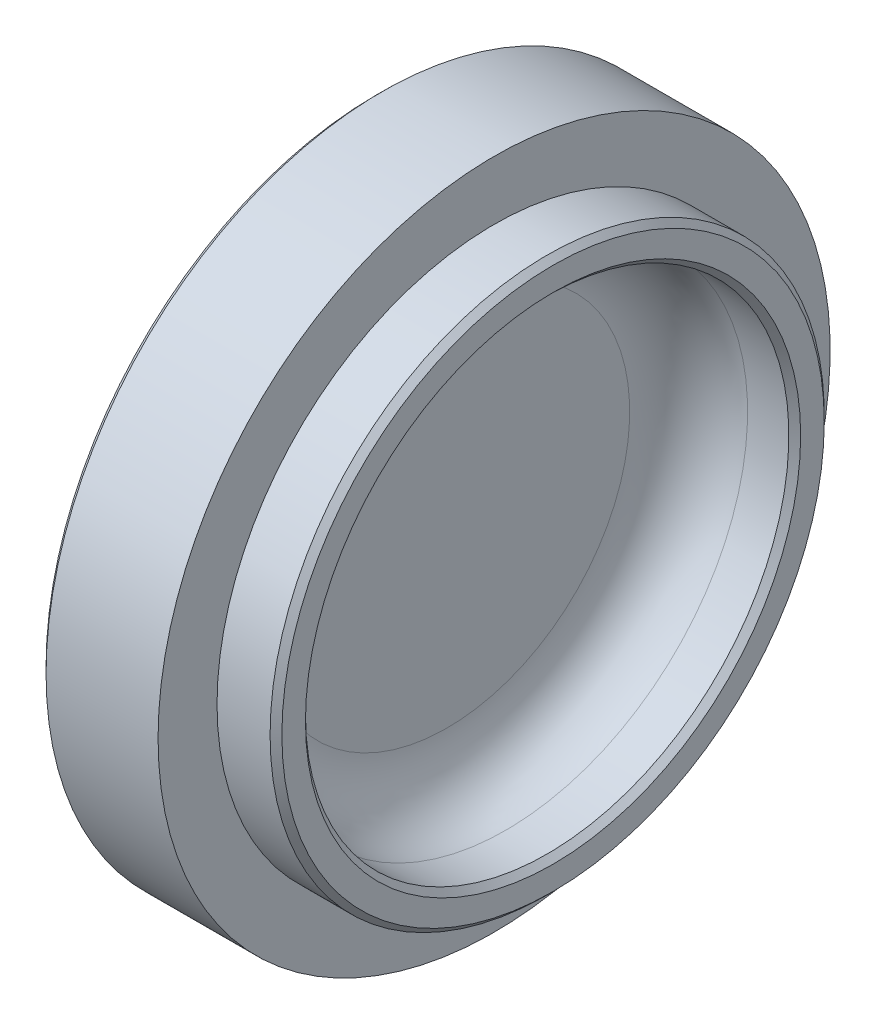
ISO-10303-21;
HEADER;
FILE_DESCRIPTION(('STEP AP214'),'2;1');
FILE_NAME('part.step','',(''),(''),'','','');
FILE_SCHEMA(('AUTOMOTIVE_DESIGN { 1 0 10303 214 1 1 1 1 }'));
ENDSEC;
DATA;
#1=APPLICATION_CONTEXT('core data for automotive mechanical design processes');
#2=APPLICATION_PROTOCOL_DEFINITION('international standard','automotive_design',2000,#1);
#3=PRODUCT_CONTEXT('',#1,'mechanical');
#4=PRODUCT('Part','Part','',(#3));
#5=PRODUCT_RELATED_PRODUCT_CATEGORY('part','',(#4));
#6=PRODUCT_DEFINITION_FORMATION('','',#4);
#7=PRODUCT_DEFINITION_CONTEXT('part definition',#1,'design');
#8=PRODUCT_DEFINITION('design','',#6,#7);
#9=PRODUCT_DEFINITION_SHAPE('','',#8);
#10=(LENGTH_UNIT() NAMED_UNIT(*) SI_UNIT(.MILLI.,.METRE.));
#11=(NAMED_UNIT(*) PLANE_ANGLE_UNIT() SI_UNIT($,.RADIAN.));
#12=(NAMED_UNIT(*) SI_UNIT($,.STERADIAN.) SOLID_ANGLE_UNIT());
#13=UNCERTAINTY_MEASURE_WITH_UNIT(LENGTH_MEASURE(1.E-05),#10,'distance_accuracy_value','');
#14=(GEOMETRIC_REPRESENTATION_CONTEXT(3) GLOBAL_UNCERTAINTY_ASSIGNED_CONTEXT((#13)) GLOBAL_UNIT_ASSIGNED_CONTEXT((#10,
#11,#12)) REPRESENTATION_CONTEXT('',''));
#15=CARTESIAN_POINT('',(0.,0.,0.));
#16=DIRECTION('',(0.,0.,1.));
#17=DIRECTION('',(1.,0.,0.));
#18=AXIS2_PLACEMENT_3D('',#15,#16,#17);
#19=CARTESIAN_POINT('',(0.,0.,0.));
#20=DIRECTION('',(1.,0.,0.));
#21=DIRECTION('',(0.,0.,-1.));
#22=AXIS2_PLACEMENT_3D('',#19,#20,#21);
#23=PLANE('',#22);
#24=CARTESIAN_POINT('',(0.,0.,0.));
#25=DIRECTION('',(1.,0.,0.));
#26=DIRECTION('',(0.,0.,-1.));
#27=AXIS2_PLACEMENT_3D('',#24,#25,#26);
#28=CIRCLE('',#27,28.);
#29=CARTESIAN_POINT('',(0.,0.,-28.));
#30=VERTEX_POINT('',#29);
#31=EDGE_CURVE('E41',#30,#30,#28,.F.);
#32=ORIENTED_EDGE('',*,*,#31,.T.);
#33=EDGE_LOOP('',(#32));
#34=FACE_BOUND('',#33,.T.);
#35=ADVANCED_FACE('F31',(#34),#23,.F.);
#36=CARTESIAN_POINT('',(0.,0.,0.));
#37=DIRECTION('',(-1.,0.,0.));
#38=DIRECTION('',(0.,0.,1.));
#39=AXIS2_PLACEMENT_3D('',#36,#37,#38);
#40=CYLINDRICAL_SURFACE('',#39,28.5);
#41=CARTESIAN_POINT('',(0.5,0.,0.));
#42=DIRECTION('',(1.,0.,0.));
#43=DIRECTION('',(0.,0.,-1.));
#44=AXIS2_PLACEMENT_3D('',#41,#42,#43);
#45=CIRCLE('',#44,28.5);
#46=CARTESIAN_POINT('',(0.5,0.,-28.5));
#47=VERTEX_POINT('',#46);
#48=EDGE_CURVE('E37',#47,#47,#45,.T.);
#49=ORIENTED_EDGE('',*,*,#48,.T.);
#50=EDGE_LOOP('',(#49));
#51=FACE_BOUND('',#50,.T.);
#52=CARTESIAN_POINT('',(10.,0.,0.));
#53=DIRECTION('',(-1.,0.,0.));
#54=DIRECTION('',(0.,0.,1.));
#55=AXIS2_PLACEMENT_3D('',#52,#53,#54);
#56=CIRCLE('',#55,28.5);
#57=CARTESIAN_POINT('',(10.,0.,28.5));
#58=VERTEX_POINT('',#57);
#59=EDGE_CURVE('E56',#58,#58,#56,.T.);
#60=ORIENTED_EDGE('',*,*,#59,.T.);
#61=EDGE_LOOP('',(#60));
#62=FACE_BOUND('',#61,.T.);
#63=ADVANCED_FACE('F86',(#51,#62),#40,.T.);
#64=CARTESIAN_POINT('',(10.,28.5,0.));
#65=DIRECTION('',(-1.,0.,0.));
#66=DIRECTION('',(0.,0.,1.));
#67=AXIS2_PLACEMENT_3D('',#64,#65,#66);
#68=PLANE('',#67);
#69=ORIENTED_EDGE('',*,*,#59,.F.);
#70=EDGE_LOOP('',(#69));
#71=FACE_BOUND('',#70,.T.);
#72=CARTESIAN_POINT('',(10.,0.,0.));
#73=DIRECTION('',(-1.,0.,0.));
#74=DIRECTION('',(0.,0.,1.));
#75=AXIS2_PLACEMENT_3D('',#72,#73,#74);
#76=CIRCLE('',#75,23.5);
#77=CARTESIAN_POINT('',(10.,0.,23.5));
#78=VERTEX_POINT('',#77);
#79=EDGE_CURVE('E59',#78,#78,#76,.T.);
#80=ORIENTED_EDGE('',*,*,#79,.T.);
#81=EDGE_LOOP('',(#80));
#82=FACE_BOUND('',#81,.T.);
#83=ADVANCED_FACE('F91',(#71,#82),#68,.F.);
#84=CARTESIAN_POINT('',(0.,0.,0.));
#85=DIRECTION('',(-1.,0.,0.));
#86=DIRECTION('',(0.,0.,1.));
#87=AXIS2_PLACEMENT_3D('',#84,#85,#86);
#88=CYLINDRICAL_SURFACE('',#87,23.5);
#89=CARTESIAN_POINT('',(14.5,0.,0.));
#90=DIRECTION('',(-1.,0.,0.));
#91=DIRECTION('',(0.,0.,1.));
#92=AXIS2_PLACEMENT_3D('',#89,#90,#91);
#93=CIRCLE('',#92,23.5);
#94=CARTESIAN_POINT('',(14.5,0.,23.5));
#95=VERTEX_POINT('',#94);
#96=EDGE_CURVE('E53',#95,#95,#93,.T.);
#97=ORIENTED_EDGE('',*,*,#96,.T.);
#98=EDGE_LOOP('',(#97));
#99=FACE_BOUND('',#98,.T.);
#100=ORIENTED_EDGE('',*,*,#79,.F.);
#101=EDGE_LOOP('',(#100));
#102=FACE_BOUND('',#101,.T.);
#103=ADVANCED_FACE('F110',(#99,#102),#88,.T.);
#104=CARTESIAN_POINT('',(15.,23.5,0.));
#105=DIRECTION('',(-1.,0.,0.));
#106=DIRECTION('',(0.,0.,1.));
#107=AXIS2_PLACEMENT_3D('',#104,#105,#106);
#108=PLANE('',#107);
#109=CARTESIAN_POINT('',(15.,0.,0.));
#110=DIRECTION('',(-1.,0.,0.));
#111=DIRECTION('',(0.,0.,1.));
#112=AXIS2_PLACEMENT_3D('',#109,#110,#111);
#113=CIRCLE('',#112,23.);
#114=CARTESIAN_POINT('',(15.,0.,23.));
#115=VERTEX_POINT('',#114);
#116=EDGE_CURVE('E45',#115,#115,#113,.F.);
#117=ORIENTED_EDGE('',*,*,#116,.T.);
#118=EDGE_LOOP('',(#117));
#119=FACE_BOUND('',#118,.T.);
#120=CARTESIAN_POINT('',(15.,0.,0.));
#121=DIRECTION('',(-1.,0.,0.));
#122=DIRECTION('',(0.,0.,1.));
#123=AXIS2_PLACEMENT_3D('',#120,#121,#122);
#124=CIRCLE('',#123,21.);
#125=CARTESIAN_POINT('',(15.,0.,21.));
#126=VERTEX_POINT('',#125);
#127=EDGE_CURVE('E50',#126,#126,#124,.T.);
#128=ORIENTED_EDGE('',*,*,#127,.T.);
#129=EDGE_LOOP('',(#128));
#130=FACE_BOUND('',#129,.T.);
#131=ADVANCED_FACE('F108',(#119,#130),#108,.F.);
#132=CARTESIAN_POINT('',(0.,0.,0.));
#133=DIRECTION('',(-1.,0.,0.));
#134=DIRECTION('',(0.,0.,1.));
#135=AXIS2_PLACEMENT_3D('',#132,#133,#134);
#136=CYLINDRICAL_SURFACE('',#135,20.5);
#137=CARTESIAN_POINT('',(14.5,0.,0.));
#138=DIRECTION('',(-1.,0.,0.));
#139=DIRECTION('',(0.,0.,1.));
#140=AXIS2_PLACEMENT_3D('',#137,#138,#139);
#141=CIRCLE('',#140,20.5);
#142=CARTESIAN_POINT('',(14.5,0.,20.5));
#143=VERTEX_POINT('',#142);
#144=EDGE_CURVE('E10',#143,#143,#141,.F.);
#145=ORIENTED_EDGE('',*,*,#144,.T.);
#146=EDGE_LOOP('',(#145));
#147=FACE_BOUND('',#146,.T.);
#148=CARTESIAN_POINT('',(11.,0.,0.));
#149=DIRECTION('',(-1.,0.,0.));
#150=DIRECTION('',(0.,0.,1.));
#151=AXIS2_PLACEMENT_3D('',#148,#149,#150);
#152=CIRCLE('',#151,20.5);
#153=CARTESIAN_POINT('',(11.,0.,20.5));
#154=VERTEX_POINT('',#153);
#155=EDGE_CURVE('E62',#154,#154,#152,.T.);
#156=ORIENTED_EDGE('',*,*,#155,.T.);
#157=EDGE_LOOP('',(#156));
#158=FACE_BOUND('',#157,.T.);
#159=ADVANCED_FACE('F82',(#147,#158),#136,.F.);
#160=CARTESIAN_POINT('',(11.,0.,0.));
#161=DIRECTION('',(-1.,0.,0.));
#162=DIRECTION('',(0.,0.,1.));
#163=AXIS2_PLACEMENT_3D('',#160,#161,#162);
#164=TOROIDAL_SURFACE('',#163,15.5,5.);
#165=ORIENTED_EDGE('',*,*,#155,.F.);
#166=EDGE_LOOP('',(#165));
#167=FACE_BOUND('',#166,.T.);
#168=CARTESIAN_POINT('',(6.00000000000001,0.,0.));
#169=DIRECTION('',(-1.,0.,0.));
#170=DIRECTION('',(0.,0.,1.));
#171=AXIS2_PLACEMENT_3D('',#168,#169,#170);
#172=CIRCLE('',#171,15.5);
#173=CARTESIAN_POINT('',(6.00000000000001,0.,15.5));
#174=VERTEX_POINT('',#173);
#175=EDGE_CURVE('E65',#174,#174,#172,.T.);
#176=ORIENTED_EDGE('',*,*,#175,.T.);
#177=EDGE_LOOP('',(#176));
#178=FACE_BOUND('',#177,.T.);
#179=ADVANCED_FACE('F69',(#167,#178),#164,.F.);
#180=CARTESIAN_POINT('',(6.00000000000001,15.5,0.));
#181=DIRECTION('',(-1.,0.,0.));
#182=DIRECTION('',(0.,0.,1.));
#183=AXIS2_PLACEMENT_3D('',#180,#181,#182);
#184=PLANE('',#183);
#185=ORIENTED_EDGE('',*,*,#175,.F.);
#186=EDGE_LOOP('',(#185));
#187=FACE_BOUND('',#186,.T.);
#188=ADVANCED_FACE('F71',(#187),#184,.F.);
#189=CARTESIAN_POINT('',(14.5,0.,0.));
#190=DIRECTION('',(-1.,0.,0.));
#191=DIRECTION('',(0.,0.,1.));
#192=AXIS2_PLACEMENT_3D('',#189,#190,#191);
#193=CONICAL_SURFACE('',#192,23.5,0.785398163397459);
#194=ORIENTED_EDGE('',*,*,#116,.F.);
#195=EDGE_LOOP('',(#194));
#196=FACE_BOUND('',#195,.T.);
#197=ORIENTED_EDGE('',*,*,#96,.F.);
#198=EDGE_LOOP('',(#197));
#199=FACE_BOUND('',#198,.T.);
#200=ADVANCED_FACE('F73',(#196,#199),#193,.T.);
#201=CARTESIAN_POINT('',(0.,0.,0.));
#202=DIRECTION('',(1.,0.,0.));
#203=DIRECTION('',(0.,0.,-1.));
#204=AXIS2_PLACEMENT_3D('',#201,#202,#203);
#205=CONICAL_SURFACE('',#204,28.,0.785398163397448);
#206=ORIENTED_EDGE('',*,*,#48,.F.);
#207=EDGE_LOOP('',(#206));
#208=FACE_BOUND('',#207,.T.);
#209=ORIENTED_EDGE('',*,*,#31,.F.);
#210=EDGE_LOOP('',(#209));
#211=FACE_BOUND('',#210,.T.);
#212=ADVANCED_FACE('F79',(#208,#211),#205,.T.);
#213=CARTESIAN_POINT('',(15.,0.,0.));
#214=DIRECTION('',(1.,0.,0.));
#215=DIRECTION('',(0.,0.,-1.));
#216=AXIS2_PLACEMENT_3D('',#213,#214,#215);
#217=CONICAL_SURFACE('',#216,21.,0.785398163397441);
#218=ORIENTED_EDGE('',*,*,#144,.F.);
#219=EDGE_LOOP('',(#218));
#220=FACE_BOUND('',#219,.T.);
#221=ORIENTED_EDGE('',*,*,#127,.F.);
#222=EDGE_LOOP('',(#221));
#223=FACE_BOUND('',#222,.T.);
#224=ADVANCED_FACE('F95',(#220,#223),#217,.F.);
#225=CLOSED_SHELL('',(#35,#63,#83,#103,#131,#159,#179,#188,#200,#212,#224));
#226=MANIFOLD_SOLID_BREP('B2',#225);
#227=ADVANCED_BREP_SHAPE_REPRESENTATION('',(#18,#226),#14);
#228=SHAPE_DEFINITION_REPRESENTATION(#9,#227);
ENDSEC;
END-ISO-10303-21;
